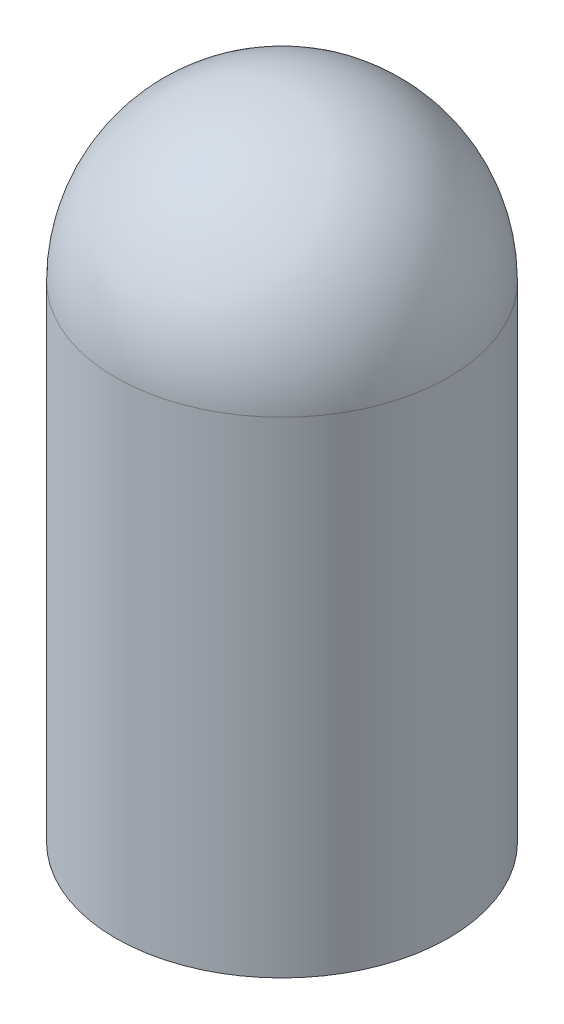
from build123d import *


with BuildPart() as part:
    # Sketch3 → Revolve1 (revolve)
    with BuildSketch(Plane.XY, mode=Mode.PRIVATE) as revolve1_sk:
        with BuildLine():
            Line((-12, 0), (-12, 35))
            ThreePointArc((-12, 35), (-8.485281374, 43.485281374), (0, 47))
            Line((0, 47), (0, 45.5))
            ThreePointArc((0, 45.5), (-7.424621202, 42.424621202), (-10.5, 35))
            Line((-10.5, 35), (-10.5, 0))
            Line((-10.5, 0), (-12, 0))
        make_face()
    revolve(revolve1_sk.sketch.rotate(Axis((0, 0, 0), (0, -1, 0)), 270), axis=Axis((0, 0, 0), (0, -1, 0)))


solid = part.part
